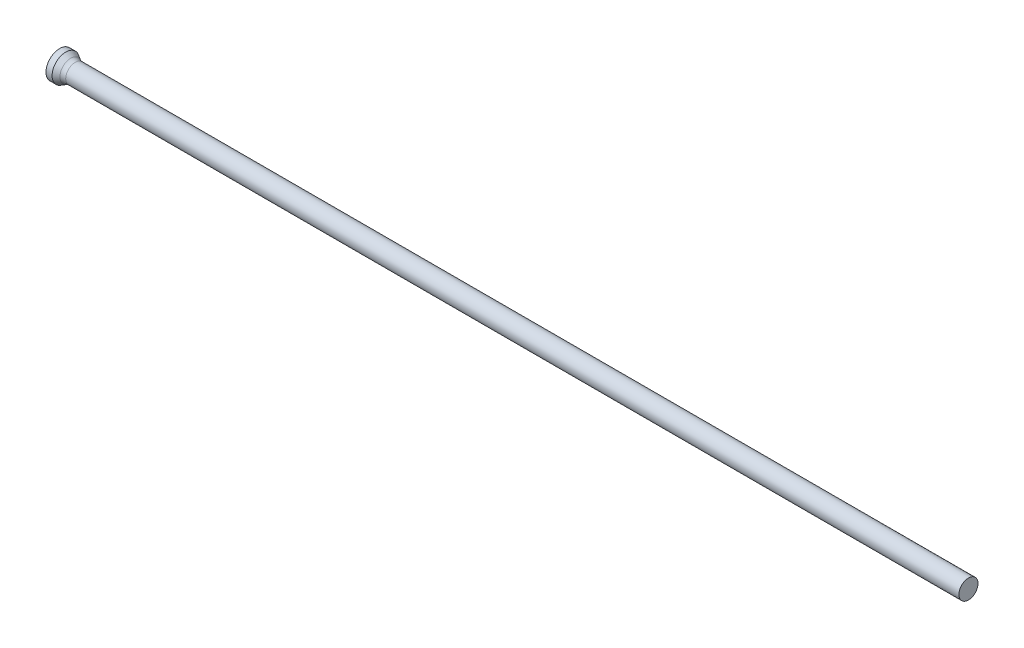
ISO-10303-21;
HEADER;
FILE_DESCRIPTION(('STEP AP214'),'2;1');
FILE_NAME('part.step','',(''),(''),'','','');
FILE_SCHEMA(('AUTOMOTIVE_DESIGN { 1 0 10303 214 1 1 1 1 }'));
ENDSEC;
DATA;
#1=APPLICATION_CONTEXT('core data for automotive mechanical design processes');
#2=APPLICATION_PROTOCOL_DEFINITION('international standard','automotive_design',2000,#1);
#3=PRODUCT_CONTEXT('',#1,'mechanical');
#4=PRODUCT('Part','Part','',(#3));
#5=PRODUCT_RELATED_PRODUCT_CATEGORY('part','',(#4));
#6=PRODUCT_DEFINITION_FORMATION('','',#4);
#7=PRODUCT_DEFINITION_CONTEXT('part definition',#1,'design');
#8=PRODUCT_DEFINITION('design','',#6,#7);
#9=PRODUCT_DEFINITION_SHAPE('','',#8);
#10=(LENGTH_UNIT() NAMED_UNIT(*) SI_UNIT(.MILLI.,.METRE.));
#11=(NAMED_UNIT(*) PLANE_ANGLE_UNIT() SI_UNIT($,.RADIAN.));
#12=(NAMED_UNIT(*) SI_UNIT($,.STERADIAN.) SOLID_ANGLE_UNIT());
#13=UNCERTAINTY_MEASURE_WITH_UNIT(LENGTH_MEASURE(1.E-05),#10,'distance_accuracy_value','');
#14=(GEOMETRIC_REPRESENTATION_CONTEXT(3) GLOBAL_UNCERTAINTY_ASSIGNED_CONTEXT((#13)) GLOBAL_UNIT_ASSIGNED_CONTEXT((#10,
#11,#12)) REPRESENTATION_CONTEXT('',''));
#15=CARTESIAN_POINT('',(0.,0.,0.));
#16=DIRECTION('',(0.,0.,1.));
#17=DIRECTION('',(1.,0.,0.));
#18=AXIS2_PLACEMENT_3D('',#15,#16,#17);
#19=CARTESIAN_POINT('',(0.,0.,0.));
#20=DIRECTION('',(1.,0.,0.));
#21=DIRECTION('',(0.,0.,-1.));
#22=AXIS2_PLACEMENT_3D('',#19,#20,#21);
#23=PLANE('',#22);
#24=CARTESIAN_POINT('',(0.,0.,0.));
#25=DIRECTION('',(-1.,0.,0.));
#26=DIRECTION('',(0.,0.,1.));
#27=AXIS2_PLACEMENT_3D('',#24,#25,#26);
#28=CIRCLE('',#27,1.5);
#29=CARTESIAN_POINT('',(0.,0.,1.5));
#30=VERTEX_POINT('',#29);
#31=EDGE_CURVE('E25',#30,#30,#28,.T.);
#32=ORIENTED_EDGE('',*,*,#31,.T.);
#33=EDGE_LOOP('',(#32));
#34=FACE_BOUND('',#33,.T.);
#35=ADVANCED_FACE('F14',(#34),#23,.F.);
#36=CARTESIAN_POINT('',(0.,0.,0.));
#37=DIRECTION('',(-1.,0.,0.));
#38=DIRECTION('',(0.,0.,1.));
#39=AXIS2_PLACEMENT_3D('',#36,#37,#38);
#40=CYLINDRICAL_SURFACE('',#39,1.5);
#41=ORIENTED_EDGE('',*,*,#31,.F.);
#42=EDGE_LOOP('',(#41));
#43=FACE_BOUND('',#42,.T.);
#44=CARTESIAN_POINT('',(0.670577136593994,0.,0.));
#45=DIRECTION('',(-1.,0.,0.));
#46=DIRECTION('',(0.,0.,1.));
#47=AXIS2_PLACEMENT_3D('',#44,#45,#46);
#48=CIRCLE('',#47,1.5);
#49=CARTESIAN_POINT('',(0.670577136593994,0.,1.5));
#50=VERTEX_POINT('',#49);
#51=EDGE_CURVE('E29',#50,#50,#48,.T.);
#52=ORIENTED_EDGE('',*,*,#51,.T.);
#53=EDGE_LOOP('',(#52));
#54=FACE_BOUND('',#53,.T.);
#55=ADVANCED_FACE('F53',(#43,#54),#40,.T.);
#56=CARTESIAN_POINT('',(1.45,0.,0.));
#57=DIRECTION('',(-1.,0.,0.));
#58=DIRECTION('',(0.,0.,1.));
#59=AXIS2_PLACEMENT_3D('',#56,#57,#58);
#60=CONICAL_SURFACE('',#59,1.05,0.523598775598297);
#61=CARTESIAN_POINT('',(1.21794919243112,0.,0.));
#62=DIRECTION('',(-1.,0.,0.));
#63=DIRECTION('',(0.,0.,1.));
#64=AXIS2_PLACEMENT_3D('',#61,#62,#63);
#65=CIRCLE('',#64,1.18397459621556);
#66=CARTESIAN_POINT('',(1.21794919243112,0.,1.18397459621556));
#67=VERTEX_POINT('',#66);
#68=EDGE_CURVE('E21',#67,#67,#65,.T.);
#69=ORIENTED_EDGE('',*,*,#68,.T.);
#70=EDGE_LOOP('',(#69));
#71=FACE_BOUND('',#70,.T.);
#72=ORIENTED_EDGE('',*,*,#51,.F.);
#73=EDGE_LOOP('',(#72));
#74=FACE_BOUND('',#73,.T.);
#75=ADVANCED_FACE('F50',(#71,#74),#60,.T.);
#76=CARTESIAN_POINT('',(0.,0.,0.));
#77=DIRECTION('',(-1.,0.,0.));
#78=DIRECTION('',(0.,0.,1.));
#79=AXIS2_PLACEMENT_3D('',#76,#77,#78);
#80=CYLINDRICAL_SURFACE('',#79,1.05);
#81=CARTESIAN_POINT('',(1.71794919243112,0.,0.));
#82=DIRECTION('',(-1.,0.,0.));
#83=DIRECTION('',(0.,0.,1.));
#84=AXIS2_PLACEMENT_3D('',#81,#82,#83);
#85=CIRCLE('',#84,1.05);
#86=CARTESIAN_POINT('',(1.71794919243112,0.,1.05));
#87=VERTEX_POINT('',#86);
#88=EDGE_CURVE('E9',#87,#87,#85,.F.);
#89=ORIENTED_EDGE('',*,*,#88,.T.);
#90=EDGE_LOOP('',(#89));
#91=FACE_BOUND('',#90,.T.);
#92=CARTESIAN_POINT('',(100.,0.,0.));
#93=DIRECTION('',(-1.,0.,0.));
#94=DIRECTION('',(0.,0.,1.));
#95=AXIS2_PLACEMENT_3D('',#92,#93,#94);
#96=CIRCLE('',#95,1.05);
#97=CARTESIAN_POINT('',(100.,0.,1.05));
#98=VERTEX_POINT('',#97);
#99=EDGE_CURVE('E34',#98,#98,#96,.T.);
#100=ORIENTED_EDGE('',*,*,#99,.T.);
#101=EDGE_LOOP('',(#100));
#102=FACE_BOUND('',#101,.T.);
#103=ADVANCED_FACE('F38',(#91,#102),#80,.T.);
#104=CARTESIAN_POINT('',(100.,1.05,0.));
#105=DIRECTION('',(-1.,0.,0.));
#106=DIRECTION('',(0.,0.,1.));
#107=AXIS2_PLACEMENT_3D('',#104,#105,#106);
#108=PLANE('',#107);
#109=ORIENTED_EDGE('',*,*,#99,.F.);
#110=EDGE_LOOP('',(#109));
#111=FACE_BOUND('',#110,.T.);
#112=ADVANCED_FACE('F40',(#111),#108,.F.);
#113=CARTESIAN_POINT('',(1.71794919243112,0.,0.));
#114=DIRECTION('',(-1.,0.,0.));
#115=DIRECTION('',(0.,0.,1.));
#116=AXIS2_PLACEMENT_3D('',#113,#114,#115);
#117=TOROIDAL_SURFACE('',#116,2.05,1.);
#118=ORIENTED_EDGE('',*,*,#88,.F.);
#119=EDGE_LOOP('',(#118));
#120=FACE_BOUND('',#119,.T.);
#121=ORIENTED_EDGE('',*,*,#68,.F.);
#122=EDGE_LOOP('',(#121));
#123=FACE_BOUND('',#122,.T.);
#124=ADVANCED_FACE('F16',(#120,#123),#117,.F.);
#125=CLOSED_SHELL('',(#35,#55,#75,#103,#112,#124));
#126=MANIFOLD_SOLID_BREP('B1',#125);
#127=ADVANCED_BREP_SHAPE_REPRESENTATION('',(#18,#126),#14);
#128=SHAPE_DEFINITION_REPRESENTATION(#9,#127);
ENDSEC;
END-ISO-10303-21;
